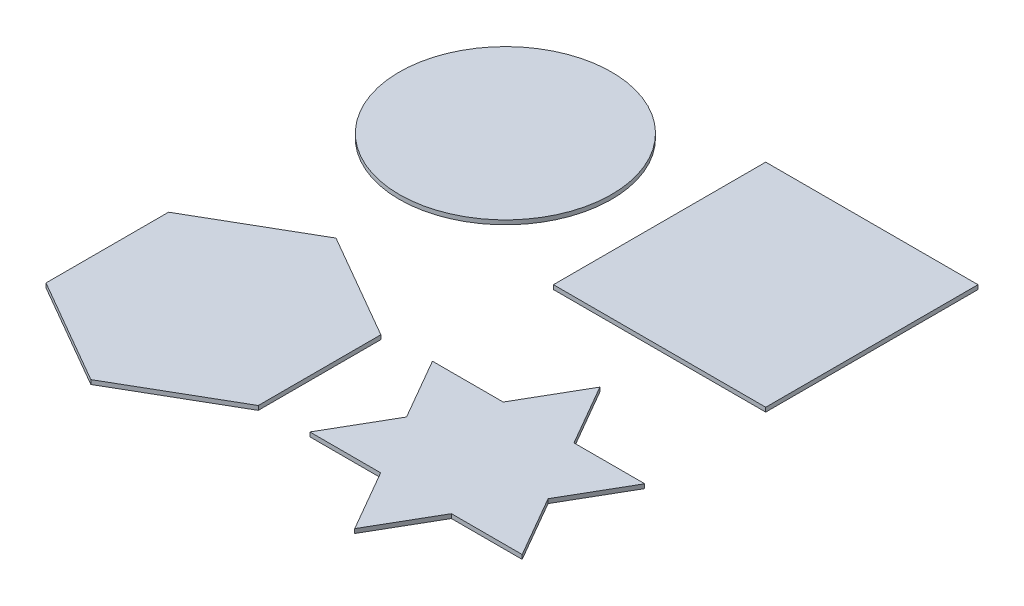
from build123d import *

# Parameters (mm, degrees)
SKETCH1_R        = 25
EXTRUDE1_DEPTH   = 1
EXTRUDE1_2_DEPTH = 1
SKETCH1_W        = 50
SKETCH1_H        = 50
EXTRUDE1_3_DEPTH = 1
EXTRUDE1_4_DEPTH = 1


with BuildPart() as part:
    # Sketch1 → Extrude1 (new body)
    with BuildSketch(Plane(origin=(0, 0, 0), x_dir=(1, 0, 0), z_dir=(0, 1, 0))):
        with Locations(Location((0, 0, 0), (0, 0, 270))):
            Circle(SKETCH1_R)
    extrude(amount=EXTRUDE1_DEPTH)


with BuildPart() as body_2:
    # Sketch1 → Extrude1 2 (new body)
    with BuildSketch(Plane(origin=(0, 0, 0), x_dir=(1, 0, 0), z_dir=(0, 1, 0))):
        Polygon((62.90148814, -40.653972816), (71.234821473, -55.087729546), (87.90148814, -55.087729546), (79.568154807, -69.521486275), (87.90148814, -83.955243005), (71.234821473, -83.955243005), (62.90148814, -98.388999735), (54.568154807, -83.955243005), (37.90148814, -83.955243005), (46.234821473, -69.521486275), (37.90148814, -55.087729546), (54.568154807, -55.087729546), align=None)
    extrude(amount=EXTRUDE1_2_DEPTH)


with BuildPart() as body_3:
    # Sketch1 → Extrude1 3 (new body)
    with BuildSketch(Plane(origin=(0, 0, 0), x_dir=(1, 0, 0), z_dir=(0, 1, 0))):
        with Locations((61.543321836, -0.232582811)):
            Rectangle(SKETCH1_W, SKETCH1_H)
    extrude(amount=EXTRUDE1_3_DEPTH)


with BuildPart() as body_4:
    # Sketch1 → Extrude1 4 (new body)
    with BuildSketch(Plane(origin=(0, 0, 0), x_dir=(1, 0, 0), z_dir=(0, 1, 0))):
        Polygon((1.428393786, -41.335316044), (-23.571606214, -55.769072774), (-23.571606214, -84.636586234), (1.428393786, -99.070342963), (26.428393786, -84.636586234), (26.428393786, -55.769072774), align=None)
    extrude(amount=EXTRUDE1_4_DEPTH)


solid = Compound([part.part, body_2.part, body_3.part, body_4.part])
